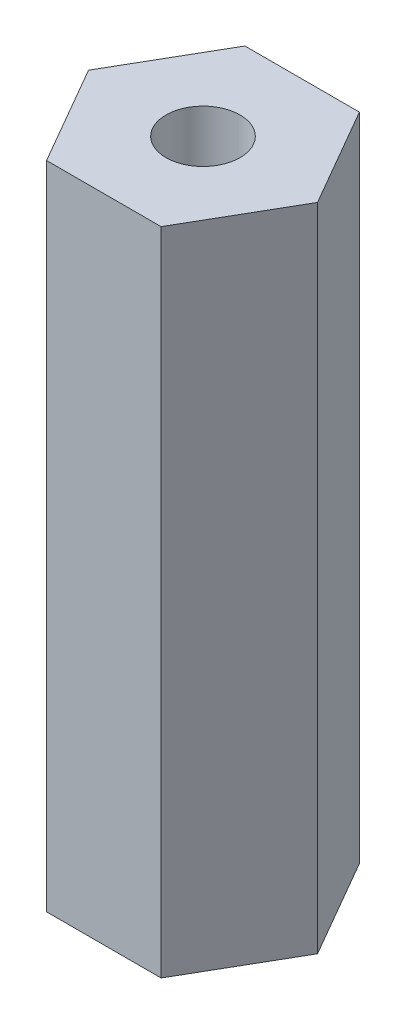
ISO-10303-21;
HEADER;
FILE_DESCRIPTION(('STEP AP214'),'2;1');
FILE_NAME('part.step','',(''),(''),'','','');
FILE_SCHEMA(('AUTOMOTIVE_DESIGN { 1 0 10303 214 1 1 1 1 }'));
ENDSEC;
DATA;
#1=APPLICATION_CONTEXT('core data for automotive mechanical design processes');
#2=APPLICATION_PROTOCOL_DEFINITION('international standard','automotive_design',2000,#1);
#3=PRODUCT_CONTEXT('',#1,'mechanical');
#4=PRODUCT('Part','Part','',(#3));
#5=PRODUCT_RELATED_PRODUCT_CATEGORY('part','',(#4));
#6=PRODUCT_DEFINITION_FORMATION('','',#4);
#7=PRODUCT_DEFINITION_CONTEXT('part definition',#1,'design');
#8=PRODUCT_DEFINITION('design','',#6,#7);
#9=PRODUCT_DEFINITION_SHAPE('','',#8);
#10=(LENGTH_UNIT() NAMED_UNIT(*) SI_UNIT(.MILLI.,.METRE.));
#11=(NAMED_UNIT(*) PLANE_ANGLE_UNIT() SI_UNIT($,.RADIAN.));
#12=(NAMED_UNIT(*) SI_UNIT($,.STERADIAN.) SOLID_ANGLE_UNIT());
#13=UNCERTAINTY_MEASURE_WITH_UNIT(LENGTH_MEASURE(1.E-05),#10,'distance_accuracy_value','');
#14=(GEOMETRIC_REPRESENTATION_CONTEXT(3) GLOBAL_UNCERTAINTY_ASSIGNED_CONTEXT((#13)) GLOBAL_UNIT_ASSIGNED_CONTEXT((#10,
#11,#12)) REPRESENTATION_CONTEXT('',''));
#15=CARTESIAN_POINT('',(0.,0.,0.));
#16=DIRECTION('',(0.,0.,1.));
#17=DIRECTION('',(1.,0.,0.));
#18=AXIS2_PLACEMENT_3D('',#15,#16,#17);
#19=CARTESIAN_POINT('',(2.19970452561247,25.000000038,3.81));
#20=DIRECTION('',(-0.866025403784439,0.,-0.5));
#21=DIRECTION('',(-0.5,0.,0.866025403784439));
#22=AXIS2_PLACEMENT_3D('',#19,#20,#21);
#23=PLANE('',#22);
#24=DIRECTION('',(0.5,0.,-0.866025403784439));
#25=VECTOR('',#24,1.);
#26=CARTESIAN_POINT('',(2.19970452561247,0.,3.81));
#27=LINE('',#26,#25);
#28=CARTESIAN_POINT('',(2.19970452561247,0.,3.81));
#29=VERTEX_POINT('',#28);
#30=CARTESIAN_POINT('',(4.39940905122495,0.,0.));
#31=VERTEX_POINT('',#30);
#32=EDGE_CURVE('E128',#29,#31,#27,.T.);
#33=ORIENTED_EDGE('',*,*,#32,.T.);
#34=DIRECTION('',(0.,-1.,0.));
#35=VECTOR('',#34,1.);
#36=CARTESIAN_POINT('',(4.39940905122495,25.000000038,0.));
#37=LINE('',#36,#35);
#38=CARTESIAN_POINT('',(4.39940905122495,25.000000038,0.));
#39=VERTEX_POINT('',#38);
#40=EDGE_CURVE('E11',#39,#31,#37,.T.);
#41=ORIENTED_EDGE('',*,*,#40,.F.);
#42=DIRECTION('',(0.5,0.,-0.866025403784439));
#43=VECTOR('',#42,1.);
#44=CARTESIAN_POINT('',(2.19970452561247,25.000000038,3.81));
#45=LINE('',#44,#43);
#46=CARTESIAN_POINT('',(2.19970452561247,25.000000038,3.81));
#47=VERTEX_POINT('',#46);
#48=EDGE_CURVE('E145',#47,#39,#45,.T.);
#49=ORIENTED_EDGE('',*,*,#48,.F.);
#50=DIRECTION('',(0.,-1.,0.));
#51=VECTOR('',#50,1.);
#52=CARTESIAN_POINT('',(2.19970452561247,25.000000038,3.81));
#53=LINE('',#52,#51);
#54=EDGE_CURVE('E124',#47,#29,#53,.T.);
#55=ORIENTED_EDGE('',*,*,#54,.T.);
#56=EDGE_LOOP('',(#33,#41,#49,#55));
#57=FACE_BOUND('',#56,.T.);
#58=ADVANCED_FACE('F39',(#57),#23,.F.);
#59=CARTESIAN_POINT('',(4.39940905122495,25.000000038,0.));
#60=DIRECTION('',(-0.866025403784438,0.,0.5));
#61=DIRECTION('',(0.5,0.,0.866025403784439));
#62=AXIS2_PLACEMENT_3D('',#59,#60,#61);
#63=PLANE('',#62);
#64=DIRECTION('',(-0.5,0.,-0.866025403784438));
#65=VECTOR('',#64,1.);
#66=CARTESIAN_POINT('',(4.39940905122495,0.,0.));
#67=LINE('',#66,#65);
#68=CARTESIAN_POINT('',(2.19970452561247,0.,-3.81));
#69=VERTEX_POINT('',#68);
#70=EDGE_CURVE('E132',#31,#69,#67,.T.);
#71=ORIENTED_EDGE('',*,*,#70,.T.);
#72=DIRECTION('',(0.,-1.,0.));
#73=VECTOR('',#72,1.);
#74=CARTESIAN_POINT('',(2.19970452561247,25.000000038,-3.81));
#75=LINE('',#74,#73);
#76=CARTESIAN_POINT('',(2.19970452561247,25.000000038,-3.81));
#77=VERTEX_POINT('',#76);
#78=EDGE_CURVE('E48',#77,#69,#75,.T.);
#79=ORIENTED_EDGE('',*,*,#78,.F.);
#80=DIRECTION('',(-0.5,0.,-0.866025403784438));
#81=VECTOR('',#80,1.);
#82=CARTESIAN_POINT('',(4.39940905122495,25.000000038,0.));
#83=LINE('',#82,#81);
#84=EDGE_CURVE('E93',#39,#77,#83,.T.);
#85=ORIENTED_EDGE('',*,*,#84,.F.);
#86=ORIENTED_EDGE('',*,*,#40,.T.);
#87=EDGE_LOOP('',(#71,#79,#85,#86));
#88=FACE_BOUND('',#87,.T.);
#89=ADVANCED_FACE('F174',(#88),#63,.F.);
#90=CARTESIAN_POINT('',(2.19970452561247,25.000000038,-3.81));
#91=DIRECTION('',(0.,0.,1.));
#92=DIRECTION('',(1.,0.,0.));
#93=AXIS2_PLACEMENT_3D('',#90,#91,#92);
#94=PLANE('',#93);
#95=DIRECTION('',(-1.,0.,0.));
#96=VECTOR('',#95,1.);
#97=CARTESIAN_POINT('',(2.19970452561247,0.,-3.81));
#98=LINE('',#97,#96);
#99=CARTESIAN_POINT('',(-2.19970452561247,0.,-3.81));
#100=VERTEX_POINT('',#99);
#101=EDGE_CURVE('E136',#69,#100,#98,.T.);
#102=ORIENTED_EDGE('',*,*,#101,.T.);
#103=DIRECTION('',(0.,-1.,0.));
#104=VECTOR('',#103,1.);
#105=CARTESIAN_POINT('',(-2.19970452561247,25.000000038,-3.81));
#106=LINE('',#105,#104);
#107=CARTESIAN_POINT('',(-2.19970452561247,25.000000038,-3.81));
#108=VERTEX_POINT('',#107);
#109=EDGE_CURVE('E117',#108,#100,#106,.T.);
#110=ORIENTED_EDGE('',*,*,#109,.F.);
#111=DIRECTION('',(-1.,0.,0.));
#112=VECTOR('',#111,1.);
#113=CARTESIAN_POINT('',(2.19970452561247,25.000000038,-3.81));
#114=LINE('',#113,#112);
#115=EDGE_CURVE('E106',#77,#108,#114,.T.);
#116=ORIENTED_EDGE('',*,*,#115,.F.);
#117=ORIENTED_EDGE('',*,*,#78,.T.);
#118=EDGE_LOOP('',(#102,#110,#116,#117));
#119=FACE_BOUND('',#118,.T.);
#120=ADVANCED_FACE('F155',(#119),#94,.F.);
#121=CARTESIAN_POINT('',(-2.19970452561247,25.000000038,-3.81));
#122=DIRECTION('',(0.866025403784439,0.,0.5));
#123=DIRECTION('',(0.5,0.,-0.866025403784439));
#124=AXIS2_PLACEMENT_3D('',#121,#122,#123);
#125=PLANE('',#124);
#126=DIRECTION('',(-0.5,0.,0.866025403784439));
#127=VECTOR('',#126,1.);
#128=CARTESIAN_POINT('',(-2.19970452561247,0.,-3.81));
#129=LINE('',#128,#127);
#130=CARTESIAN_POINT('',(-4.39940905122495,0.,0.));
#131=VERTEX_POINT('',#130);
#132=EDGE_CURVE('E115',#100,#131,#129,.T.);
#133=ORIENTED_EDGE('',*,*,#132,.T.);
#134=DIRECTION('',(0.,-1.,0.));
#135=VECTOR('',#134,1.);
#136=CARTESIAN_POINT('',(-4.39940905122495,25.000000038,0.));
#137=LINE('',#136,#135);
#138=CARTESIAN_POINT('',(-4.39940905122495,25.000000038,0.));
#139=VERTEX_POINT('',#138);
#140=EDGE_CURVE('E112',#139,#131,#137,.T.);
#141=ORIENTED_EDGE('',*,*,#140,.F.);
#142=DIRECTION('',(-0.5,0.,0.866025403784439));
#143=VECTOR('',#142,1.);
#144=CARTESIAN_POINT('',(-2.19970452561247,25.000000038,-3.81));
#145=LINE('',#144,#143);
#146=EDGE_CURVE('E100',#108,#139,#145,.T.);
#147=ORIENTED_EDGE('',*,*,#146,.F.);
#148=ORIENTED_EDGE('',*,*,#109,.T.);
#149=EDGE_LOOP('',(#133,#141,#147,#148));
#150=FACE_BOUND('',#149,.T.);
#151=ADVANCED_FACE('F113',(#150),#125,.F.);
#152=CARTESIAN_POINT('',(-4.39940905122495,25.000000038,0.));
#153=DIRECTION('',(0.866025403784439,0.,-0.5));
#154=DIRECTION('',(-0.5,0.,-0.866025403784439));
#155=AXIS2_PLACEMENT_3D('',#152,#153,#154);
#156=PLANE('',#155);
#157=DIRECTION('',(0.5,0.,0.866025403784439));
#158=VECTOR('',#157,1.);
#159=CARTESIAN_POINT('',(-4.39940905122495,0.,0.));
#160=LINE('',#159,#158);
#161=CARTESIAN_POINT('',(-2.19970452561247,0.,3.81));
#162=VERTEX_POINT('',#161);
#163=EDGE_CURVE('E79',#131,#162,#160,.T.);
#164=ORIENTED_EDGE('',*,*,#163,.T.);
#165=DIRECTION('',(0.,-1.,0.));
#166=VECTOR('',#165,1.);
#167=CARTESIAN_POINT('',(-2.19970452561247,25.000000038,3.81));
#168=LINE('',#167,#166);
#169=CARTESIAN_POINT('',(-2.19970452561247,25.000000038,3.81));
#170=VERTEX_POINT('',#169);
#171=EDGE_CURVE('E118',#170,#162,#168,.T.);
#172=ORIENTED_EDGE('',*,*,#171,.F.);
#173=DIRECTION('',(0.5,0.,0.866025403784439));
#174=VECTOR('',#173,1.);
#175=CARTESIAN_POINT('',(-4.39940905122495,25.000000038,0.));
#176=LINE('',#175,#174);
#177=EDGE_CURVE('E104',#139,#170,#176,.T.);
#178=ORIENTED_EDGE('',*,*,#177,.F.);
#179=ORIENTED_EDGE('',*,*,#140,.T.);
#180=EDGE_LOOP('',(#164,#172,#178,#179));
#181=FACE_BOUND('',#180,.T.);
#182=ADVANCED_FACE('F120',(#181),#156,.F.);
#183=CARTESIAN_POINT('',(-2.19970452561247,25.000000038,3.81));
#184=DIRECTION('',(0.,0.,-1.));
#185=DIRECTION('',(-1.,0.,0.));
#186=AXIS2_PLACEMENT_3D('',#183,#184,#185);
#187=PLANE('',#186);
#188=DIRECTION('',(1.,0.,0.));
#189=VECTOR('',#188,1.);
#190=CARTESIAN_POINT('',(-2.19970452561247,0.,3.81));
#191=LINE('',#190,#189);
#192=EDGE_CURVE('E85',#162,#29,#191,.T.);
#193=ORIENTED_EDGE('',*,*,#192,.T.);
#194=ORIENTED_EDGE('',*,*,#54,.F.);
#195=DIRECTION('',(1.,0.,0.));
#196=VECTOR('',#195,1.);
#197=CARTESIAN_POINT('',(-2.19970452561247,25.000000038,3.81));
#198=LINE('',#197,#196);
#199=EDGE_CURVE('E56',#170,#47,#198,.T.);
#200=ORIENTED_EDGE('',*,*,#199,.F.);
#201=ORIENTED_EDGE('',*,*,#171,.T.);
#202=EDGE_LOOP('',(#193,#194,#200,#201));
#203=FACE_BOUND('',#202,.T.);
#204=ADVANCED_FACE('F162',(#203),#187,.F.);
#205=CARTESIAN_POINT('',(0.,25.000000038,0.));
#206=DIRECTION('',(0.,1.,0.));
#207=DIRECTION('',(0.,0.,1.));
#208=AXIS2_PLACEMENT_3D('',#205,#206,#207);
#209=PLANE('',#208);
#210=CARTESIAN_POINT('',(0.,25.000000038,0.));
#211=DIRECTION('',(0.,1.,0.));
#212=DIRECTION('',(0.,0.,1.));
#213=AXIS2_PLACEMENT_3D('',#210,#211,#212);
#214=CIRCLE('',#213,1.4224);
#215=CARTESIAN_POINT('',(0.,25.000000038,1.4224));
#216=VERTEX_POINT('',#215);
#217=EDGE_CURVE('E229',#216,#216,#214,.T.);
#218=ORIENTED_EDGE('',*,*,#217,.F.);
#219=EDGE_LOOP('',(#218));
#220=FACE_BOUND('',#219,.T.);
#221=ORIENTED_EDGE('',*,*,#48,.T.);
#222=ORIENTED_EDGE('',*,*,#84,.T.);
#223=ORIENTED_EDGE('',*,*,#115,.T.);
#224=ORIENTED_EDGE('',*,*,#146,.T.);
#225=ORIENTED_EDGE('',*,*,#177,.T.);
#226=ORIENTED_EDGE('',*,*,#199,.T.);
#227=EDGE_LOOP('',(#221,#222,#223,#224,#225,#226));
#228=FACE_BOUND('',#227,.T.);
#229=ADVANCED_FACE('F102',(#220,#228),#209,.T.);
#230=CARTESIAN_POINT('',(0.,0.,0.));
#231=DIRECTION('',(0.,1.,0.));
#232=DIRECTION('',(0.,0.,1.));
#233=AXIS2_PLACEMENT_3D('',#230,#231,#232);
#234=PLANE('',#233);
#235=CARTESIAN_POINT('',(0.,0.,0.));
#236=DIRECTION('',(0.,1.,0.));
#237=DIRECTION('',(0.,0.,1.));
#238=AXIS2_PLACEMENT_3D('',#235,#236,#237);
#239=CIRCLE('',#238,1.4224);
#240=CARTESIAN_POINT('',(0.,0.,1.4224));
#241=VERTEX_POINT('',#240);
#242=EDGE_CURVE('E133',#241,#241,#239,.T.);
#243=ORIENTED_EDGE('',*,*,#242,.T.);
#244=EDGE_LOOP('',(#243));
#245=FACE_BOUND('',#244,.T.);
#246=ORIENTED_EDGE('',*,*,#32,.F.);
#247=ORIENTED_EDGE('',*,*,#192,.F.);
#248=ORIENTED_EDGE('',*,*,#163,.F.);
#249=ORIENTED_EDGE('',*,*,#132,.F.);
#250=ORIENTED_EDGE('',*,*,#101,.F.);
#251=ORIENTED_EDGE('',*,*,#70,.F.);
#252=EDGE_LOOP('',(#246,#247,#248,#249,#250,#251));
#253=FACE_BOUND('',#252,.T.);
#254=ADVANCED_FACE('F158',(#245,#253),#234,.F.);
#255=CARTESIAN_POINT('',(0.,0.,0.));
#256=DIRECTION('',(0.,1.,0.));
#257=DIRECTION('',(0.,0.,1.));
#258=AXIS2_PLACEMENT_3D('',#255,#256,#257);
#259=CYLINDRICAL_SURFACE('',#258,1.4224);
#260=ORIENTED_EDGE('',*,*,#242,.F.);
#261=EDGE_LOOP('',(#260));
#262=FACE_BOUND('',#261,.T.);
#263=ORIENTED_EDGE('',*,*,#217,.T.);
#264=EDGE_LOOP('',(#263));
#265=FACE_BOUND('',#264,.T.);
#266=ADVANCED_FACE('F211',(#262,#265),#259,.F.);
#267=CLOSED_SHELL('',(#58,#89,#120,#151,#182,#204,#229,#254,#266));
#268=MANIFOLD_SOLID_BREP('B2',#267);
#269=ADVANCED_BREP_SHAPE_REPRESENTATION('',(#18,#268),#14);
#270=SHAPE_DEFINITION_REPRESENTATION(#9,#269);
ENDSEC;
END-ISO-10303-21;
